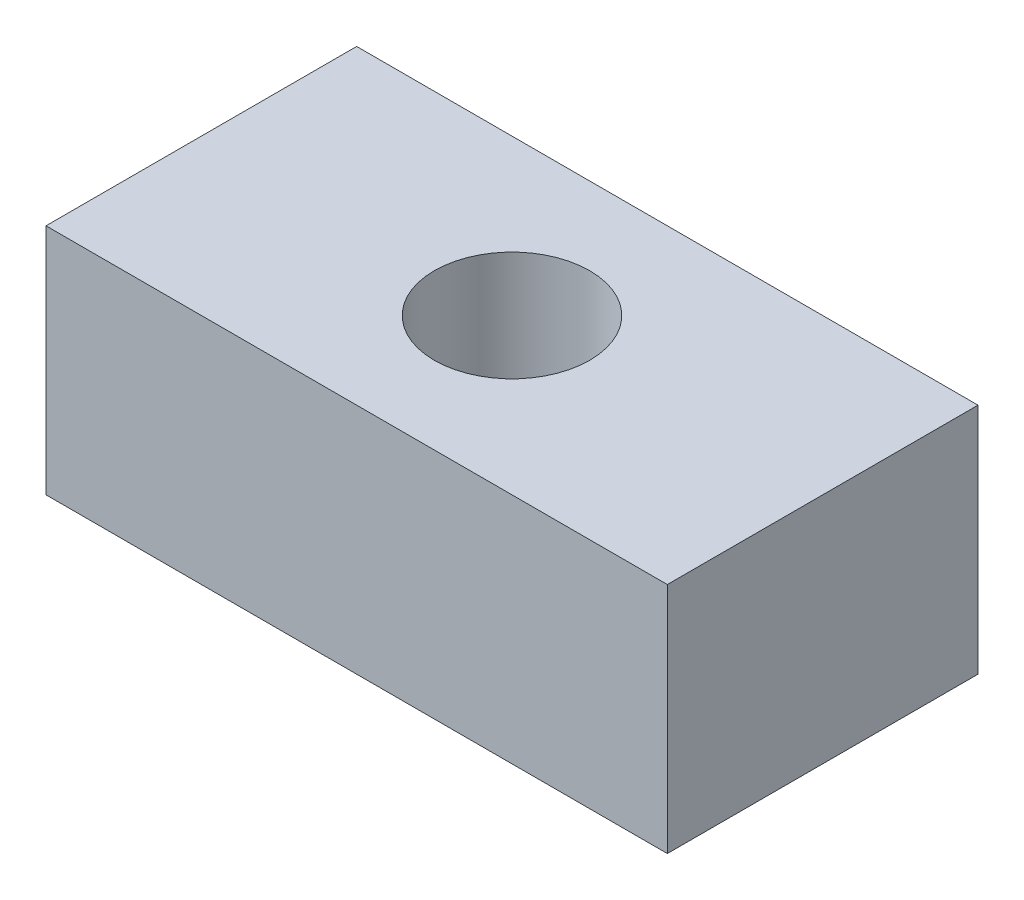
ISO-10303-21;
HEADER;
FILE_DESCRIPTION(('STEP AP214'),'2;1');
FILE_NAME('part.step','',(''),(''),'','','');
FILE_SCHEMA(('AUTOMOTIVE_DESIGN { 1 0 10303 214 1 1 1 1 }'));
ENDSEC;
DATA;
#1=APPLICATION_CONTEXT('core data for automotive mechanical design processes');
#2=APPLICATION_PROTOCOL_DEFINITION('international standard','automotive_design',2000,#1);
#3=PRODUCT_CONTEXT('',#1,'mechanical');
#4=PRODUCT('Part','Part','',(#3));
#5=PRODUCT_RELATED_PRODUCT_CATEGORY('part','',(#4));
#6=PRODUCT_DEFINITION_FORMATION('','',#4);
#7=PRODUCT_DEFINITION_CONTEXT('part definition',#1,'design');
#8=PRODUCT_DEFINITION('design','',#6,#7);
#9=PRODUCT_DEFINITION_SHAPE('','',#8);
#10=(LENGTH_UNIT() NAMED_UNIT(*) SI_UNIT(.MILLI.,.METRE.));
#11=(NAMED_UNIT(*) PLANE_ANGLE_UNIT() SI_UNIT($,.RADIAN.));
#12=(NAMED_UNIT(*) SI_UNIT($,.STERADIAN.) SOLID_ANGLE_UNIT());
#13=UNCERTAINTY_MEASURE_WITH_UNIT(LENGTH_MEASURE(1.E-05),#10,'distance_accuracy_value','');
#14=(GEOMETRIC_REPRESENTATION_CONTEXT(3) GLOBAL_UNCERTAINTY_ASSIGNED_CONTEXT((#13)) GLOBAL_UNIT_ASSIGNED_CONTEXT((#10,
#11,#12)) REPRESENTATION_CONTEXT('',''));
#15=CARTESIAN_POINT('',(0.,0.,0.));
#16=DIRECTION('',(0.,0.,1.));
#17=DIRECTION('',(1.,0.,0.));
#18=AXIS2_PLACEMENT_3D('',#15,#16,#17);
#19=CARTESIAN_POINT('',(25.4,19.05,12.7));
#20=DIRECTION('',(-1.,0.,0.));
#21=DIRECTION('',(0.,0.,1.));
#22=AXIS2_PLACEMENT_3D('',#19,#20,#21);
#23=PLANE('',#22);
#24=DIRECTION('',(0.,0.,-1.));
#25=VECTOR('',#24,1.);
#26=CARTESIAN_POINT('',(25.4,0.,12.7));
#27=LINE('',#26,#25);
#28=CARTESIAN_POINT('',(25.4,0.,12.7));
#29=VERTEX_POINT('',#28);
#30=CARTESIAN_POINT('',(25.4,0.,-12.7));
#31=VERTEX_POINT('',#30);
#32=EDGE_CURVE('E102',#29,#31,#27,.T.);
#33=ORIENTED_EDGE('',*,*,#32,.T.);
#34=DIRECTION('',(0.,-1.,0.));
#35=VECTOR('',#34,1.);
#36=CARTESIAN_POINT('',(25.4,19.05,-12.7));
#37=LINE('',#36,#35);
#38=CARTESIAN_POINT('',(25.4,19.05,-12.7));
#39=VERTEX_POINT('',#38);
#40=EDGE_CURVE('E11',#39,#31,#37,.T.);
#41=ORIENTED_EDGE('',*,*,#40,.F.);
#42=DIRECTION('',(0.,0.,-1.));
#43=VECTOR('',#42,1.);
#44=CARTESIAN_POINT('',(25.4,19.05,12.7));
#45=LINE('',#44,#43);
#46=CARTESIAN_POINT('',(25.4,19.05,12.7));
#47=VERTEX_POINT('',#46);
#48=EDGE_CURVE('E90',#47,#39,#45,.T.);
#49=ORIENTED_EDGE('',*,*,#48,.F.);
#50=DIRECTION('',(0.,-1.,0.));
#51=VECTOR('',#50,1.);
#52=CARTESIAN_POINT('',(25.4,19.05,12.7));
#53=LINE('',#52,#51);
#54=EDGE_CURVE('E98',#47,#29,#53,.T.);
#55=ORIENTED_EDGE('',*,*,#54,.T.);
#56=EDGE_LOOP('',(#33,#41,#49,#55));
#57=FACE_BOUND('',#56,.T.);
#58=ADVANCED_FACE('F39',(#57),#23,.F.);
#59=CARTESIAN_POINT('',(-25.4,19.05,-12.7));
#60=DIRECTION('',(0.,0.,1.));
#61=DIRECTION('',(1.,0.,0.));
#62=AXIS2_PLACEMENT_3D('',#59,#60,#61);
#63=PLANE('',#62);
#64=DIRECTION('',(-1.,0.,0.));
#65=VECTOR('',#64,1.);
#66=CARTESIAN_POINT('',(-25.4,0.,-12.7));
#67=LINE('',#66,#65);
#68=CARTESIAN_POINT('',(-25.4,0.,-12.7));
#69=VERTEX_POINT('',#68);
#70=EDGE_CURVE('E94',#31,#69,#67,.T.);
#71=ORIENTED_EDGE('',*,*,#70,.T.);
#72=DIRECTION('',(0.,-1.,0.));
#73=VECTOR('',#72,1.);
#74=CARTESIAN_POINT('',(-25.4,19.05,-12.7));
#75=LINE('',#74,#73);
#76=CARTESIAN_POINT('',(-25.4,19.05,-12.7));
#77=VERTEX_POINT('',#76);
#78=EDGE_CURVE('E47',#77,#69,#75,.T.);
#79=ORIENTED_EDGE('',*,*,#78,.F.);
#80=DIRECTION('',(-1.,0.,0.));
#81=VECTOR('',#80,1.);
#82=CARTESIAN_POINT('',(-25.4,19.05,-12.7));
#83=LINE('',#82,#81);
#84=EDGE_CURVE('E85',#39,#77,#83,.T.);
#85=ORIENTED_EDGE('',*,*,#84,.F.);
#86=ORIENTED_EDGE('',*,*,#40,.T.);
#87=EDGE_LOOP('',(#71,#79,#85,#86));
#88=FACE_BOUND('',#87,.T.);
#89=ADVANCED_FACE('F93',(#88),#63,.F.);
#90=CARTESIAN_POINT('',(-25.4,19.05,12.7));
#91=DIRECTION('',(1.,0.,0.));
#92=DIRECTION('',(0.,0.,-1.));
#93=AXIS2_PLACEMENT_3D('',#90,#91,#92);
#94=PLANE('',#93);
#95=DIRECTION('',(0.,0.,1.));
#96=VECTOR('',#95,1.);
#97=CARTESIAN_POINT('',(-25.4,0.,12.7));
#98=LINE('',#97,#96);
#99=CARTESIAN_POINT('',(-25.4,0.,12.7));
#100=VERTEX_POINT('',#99);
#101=EDGE_CURVE('E72',#69,#100,#98,.T.);
#102=ORIENTED_EDGE('',*,*,#101,.T.);
#103=DIRECTION('',(0.,-1.,0.));
#104=VECTOR('',#103,1.);
#105=CARTESIAN_POINT('',(-25.4,19.05,12.7));
#106=LINE('',#105,#104);
#107=CARTESIAN_POINT('',(-25.4,19.05,12.7));
#108=VERTEX_POINT('',#107);
#109=EDGE_CURVE('E95',#108,#100,#106,.T.);
#110=ORIENTED_EDGE('',*,*,#109,.F.);
#111=DIRECTION('',(0.,0.,1.));
#112=VECTOR('',#111,1.);
#113=CARTESIAN_POINT('',(-25.4,19.05,12.7));
#114=LINE('',#113,#112);
#115=EDGE_CURVE('E88',#77,#108,#114,.T.);
#116=ORIENTED_EDGE('',*,*,#115,.F.);
#117=ORIENTED_EDGE('',*,*,#78,.T.);
#118=EDGE_LOOP('',(#102,#110,#116,#117));
#119=FACE_BOUND('',#118,.T.);
#120=ADVANCED_FACE('F96',(#119),#94,.F.);
#121=CARTESIAN_POINT('',(-25.4,19.05,12.7));
#122=DIRECTION('',(0.,0.,-1.));
#123=DIRECTION('',(-1.,0.,0.));
#124=AXIS2_PLACEMENT_3D('',#121,#122,#123);
#125=PLANE('',#124);
#126=DIRECTION('',(1.,0.,0.));
#127=VECTOR('',#126,1.);
#128=CARTESIAN_POINT('',(-25.4,0.,12.7));
#129=LINE('',#128,#127);
#130=EDGE_CURVE('E78',#100,#29,#129,.T.);
#131=ORIENTED_EDGE('',*,*,#130,.T.);
#132=ORIENTED_EDGE('',*,*,#54,.F.);
#133=DIRECTION('',(1.,0.,0.));
#134=VECTOR('',#133,1.);
#135=CARTESIAN_POINT('',(-25.4,19.05,12.7));
#136=LINE('',#135,#134);
#137=EDGE_CURVE('E55',#108,#47,#136,.T.);
#138=ORIENTED_EDGE('',*,*,#137,.F.);
#139=ORIENTED_EDGE('',*,*,#109,.T.);
#140=EDGE_LOOP('',(#131,#132,#138,#139));
#141=FACE_BOUND('',#140,.T.);
#142=ADVANCED_FACE('F110',(#141),#125,.F.);
#143=CARTESIAN_POINT('',(25.4,19.05,-12.7));
#144=DIRECTION('',(0.,-1.,0.));
#145=DIRECTION('',(0.,0.,-1.));
#146=AXIS2_PLACEMENT_3D('',#143,#144,#145);
#147=PLANE('',#146);
#148=CARTESIAN_POINT('',(0.,19.05,0.));
#149=DIRECTION('',(0.,1.,0.));
#150=DIRECTION('',(0.,0.,1.));
#151=AXIS2_PLACEMENT_3D('',#148,#149,#150);
#152=CIRCLE('',#151,6.35);
#153=CARTESIAN_POINT('',(0.,19.05,6.35));
#154=VERTEX_POINT('',#153);
#155=EDGE_CURVE('E116',#154,#154,#152,.T.);
#156=ORIENTED_EDGE('',*,*,#155,.F.);
#157=EDGE_LOOP('',(#156));
#158=FACE_BOUND('',#157,.T.);
#159=ORIENTED_EDGE('',*,*,#48,.T.);
#160=ORIENTED_EDGE('',*,*,#84,.T.);
#161=ORIENTED_EDGE('',*,*,#115,.T.);
#162=ORIENTED_EDGE('',*,*,#137,.T.);
#163=EDGE_LOOP('',(#159,#160,#161,#162));
#164=FACE_BOUND('',#163,.T.);
#165=ADVANCED_FACE('F86',(#158,#164),#147,.F.);
#166=CARTESIAN_POINT('',(25.4,0.,-12.7));
#167=DIRECTION('',(0.,-1.,0.));
#168=DIRECTION('',(0.,0.,-1.));
#169=AXIS2_PLACEMENT_3D('',#166,#167,#168);
#170=PLANE('',#169);
#171=ORIENTED_EDGE('',*,*,#32,.F.);
#172=ORIENTED_EDGE('',*,*,#130,.F.);
#173=ORIENTED_EDGE('',*,*,#101,.F.);
#174=ORIENTED_EDGE('',*,*,#70,.F.);
#175=EDGE_LOOP('',(#171,#172,#173,#174));
#176=FACE_BOUND('',#175,.T.);
#177=ADVANCED_FACE('F113',(#176),#170,.T.);
#178=CARTESIAN_POINT('',(0.,6.35,0.));
#179=DIRECTION('',(0.,1.,0.));
#180=DIRECTION('',(0.,0.,1.));
#181=AXIS2_PLACEMENT_3D('',#178,#179,#180);
#182=CYLINDRICAL_SURFACE('',#181,6.35);
#183=CARTESIAN_POINT('',(0.,6.35,0.));
#184=DIRECTION('',(0.,1.,0.));
#185=DIRECTION('',(0.,0.,1.));
#186=AXIS2_PLACEMENT_3D('',#183,#184,#185);
#187=CIRCLE('',#186,6.35);
#188=CARTESIAN_POINT('',(0.,6.35,6.35));
#189=VERTEX_POINT('',#188);
#190=EDGE_CURVE('E105',#189,#189,#187,.T.);
#191=ORIENTED_EDGE('',*,*,#190,.F.);
#192=EDGE_LOOP('',(#191));
#193=FACE_BOUND('',#192,.T.);
#194=ORIENTED_EDGE('',*,*,#155,.T.);
#195=EDGE_LOOP('',(#194));
#196=FACE_BOUND('',#195,.T.);
#197=ADVANCED_FACE('F124',(#193,#196),#182,.F.);
#198=CARTESIAN_POINT('',(0.,6.35,0.));
#199=DIRECTION('',(0.,1.,0.));
#200=DIRECTION('',(0.,0.,1.));
#201=AXIS2_PLACEMENT_3D('',#198,#199,#200);
#202=PLANE('',#201);
#203=ORIENTED_EDGE('',*,*,#190,.T.);
#204=EDGE_LOOP('',(#203));
#205=FACE_BOUND('',#204,.T.);
#206=ADVANCED_FACE('F122',(#205),#202,.T.);
#207=CLOSED_SHELL('',(#58,#89,#120,#142,#165,#177,#197,#206));
#208=MANIFOLD_SOLID_BREP('B2',#207);
#209=ADVANCED_BREP_SHAPE_REPRESENTATION('',(#18,#208),#14);
#210=SHAPE_DEFINITION_REPRESENTATION(#9,#209);
ENDSEC;
END-ISO-10303-21;
